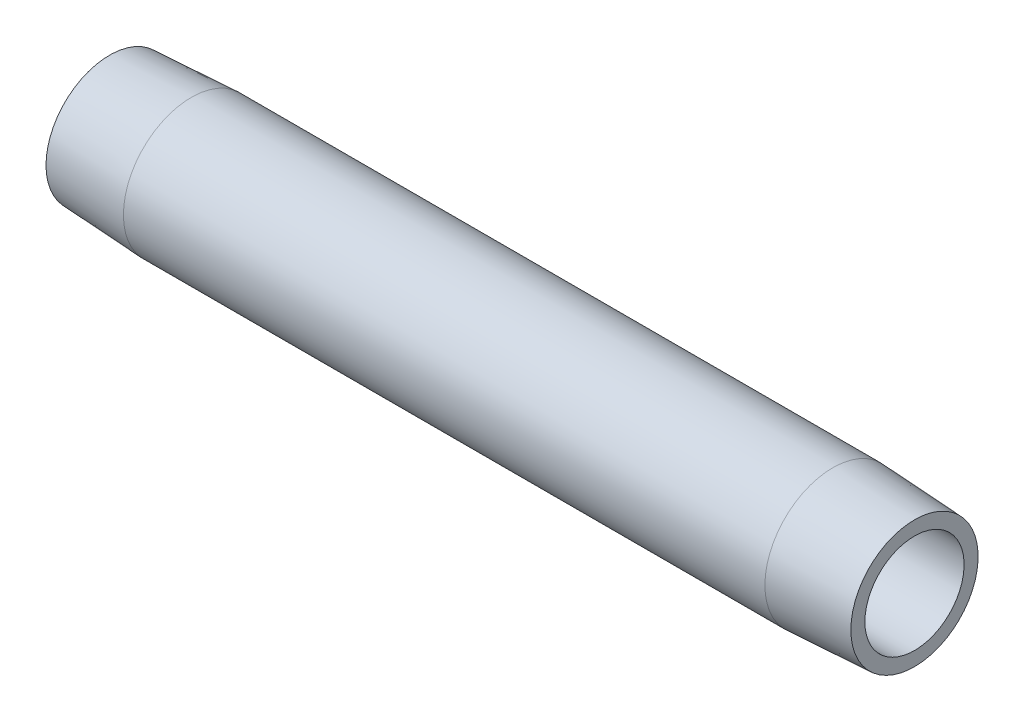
ISO-10303-21;
HEADER;
FILE_DESCRIPTION(('STEP AP214'),'2;1');
FILE_NAME('part.step','',(''),(''),'','','');
FILE_SCHEMA(('AUTOMOTIVE_DESIGN { 1 0 10303 214 1 1 1 1 }'));
ENDSEC;
DATA;
#1=APPLICATION_CONTEXT('core data for automotive mechanical design processes');
#2=APPLICATION_PROTOCOL_DEFINITION('international standard','automotive_design',2000,#1);
#3=PRODUCT_CONTEXT('',#1,'mechanical');
#4=PRODUCT('Part','Part','',(#3));
#5=PRODUCT_RELATED_PRODUCT_CATEGORY('part','',(#4));
#6=PRODUCT_DEFINITION_FORMATION('','',#4);
#7=PRODUCT_DEFINITION_CONTEXT('part definition',#1,'design');
#8=PRODUCT_DEFINITION('design','',#6,#7);
#9=PRODUCT_DEFINITION_SHAPE('','',#8);
#10=(LENGTH_UNIT() NAMED_UNIT(*) SI_UNIT(.MILLI.,.METRE.));
#11=(NAMED_UNIT(*) PLANE_ANGLE_UNIT() SI_UNIT($,.RADIAN.));
#12=(NAMED_UNIT(*) SI_UNIT($,.STERADIAN.) SOLID_ANGLE_UNIT());
#13=UNCERTAINTY_MEASURE_WITH_UNIT(LENGTH_MEASURE(1.E-05),#10,'distance_accuracy_value','');
#14=(GEOMETRIC_REPRESENTATION_CONTEXT(3) GLOBAL_UNCERTAINTY_ASSIGNED_CONTEXT((#13)) GLOBAL_UNIT_ASSIGNED_CONTEXT((#10,
#11,#12)) REPRESENTATION_CONTEXT('',''));
#15=CARTESIAN_POINT('',(0.,0.,0.));
#16=DIRECTION('',(0.,0.,1.));
#17=DIRECTION('',(1.,0.,0.));
#18=AXIS2_PLACEMENT_3D('',#15,#16,#17);
#19=CARTESIAN_POINT('',(101.6,6.26110000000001,0.));
#20=DIRECTION('',(-1.,0.,0.));
#21=DIRECTION('',(0.,0.,1.));
#22=AXIS2_PLACEMENT_3D('',#19,#20,#21);
#23=PLANE('',#22);
#24=CARTESIAN_POINT('',(101.6,0.,0.));
#25=DIRECTION('',(-1.,0.,0.));
#26=DIRECTION('',(0.,0.,1.));
#27=AXIS2_PLACEMENT_3D('',#24,#25,#26);
#28=CIRCLE('',#27,8.03205001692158);
#29=CARTESIAN_POINT('',(101.6,0.,8.03205001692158));
#30=VERTEX_POINT('',#29);
#31=EDGE_CURVE('E10',#30,#30,#28,.T.);
#32=ORIENTED_EDGE('',*,*,#31,.F.);
#33=EDGE_LOOP('',(#32));
#34=FACE_BOUND('',#33,.T.);
#35=CARTESIAN_POINT('',(101.6,0.,0.));
#36=DIRECTION('',(-1.,0.,0.));
#37=DIRECTION('',(0.,0.,1.));
#38=AXIS2_PLACEMENT_3D('',#35,#36,#37);
#39=CIRCLE('',#38,6.26110000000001);
#40=CARTESIAN_POINT('',(101.6,0.,6.26110000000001));
#41=VERTEX_POINT('',#40);
#42=EDGE_CURVE('E52',#41,#41,#39,.T.);
#43=ORIENTED_EDGE('',*,*,#42,.T.);
#44=EDGE_LOOP('',(#43));
#45=FACE_BOUND('',#44,.T.);
#46=ADVANCED_FACE('F30',(#34,#45),#23,.F.);
#47=CARTESIAN_POINT('',(101.6,0.,0.));
#48=DIRECTION('',(-1.,0.,0.));
#49=DIRECTION('',(0.,0.,1.));
#50=AXIS2_PLACEMENT_3D('',#47,#48,#49);
#51=CONICAL_SURFACE('',#50,8.03205001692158,0.0523598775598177);
#52=CARTESIAN_POINT('',(91.2876,0.,0.));
#53=DIRECTION('',(-1.,0.,0.));
#54=DIRECTION('',(0.,0.,1.));
#55=AXIS2_PLACEMENT_3D('',#52,#53,#54);
#56=CIRCLE('',#55,8.57249999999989);
#57=CARTESIAN_POINT('',(91.2876,0.,8.57249999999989));
#58=VERTEX_POINT('',#57);
#59=EDGE_CURVE('E36',#58,#58,#56,.T.);
#60=ORIENTED_EDGE('',*,*,#59,.F.);
#61=EDGE_LOOP('',(#60));
#62=FACE_BOUND('',#61,.T.);
#63=ORIENTED_EDGE('',*,*,#31,.T.);
#64=EDGE_LOOP('',(#63));
#65=FACE_BOUND('',#64,.T.);
#66=ADVANCED_FACE('F77',(#62,#65),#51,.T.);
#67=CARTESIAN_POINT('',(0.,0.,0.));
#68=DIRECTION('',(-1.,0.,0.));
#69=DIRECTION('',(0.,0.,1.));
#70=AXIS2_PLACEMENT_3D('',#67,#68,#69);
#71=CYLINDRICAL_SURFACE('',#70,8.57249999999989);
#72=CARTESIAN_POINT('',(10.3124,0.,0.));
#73=DIRECTION('',(-1.,0.,0.));
#74=DIRECTION('',(0.,0.,1.));
#75=AXIS2_PLACEMENT_3D('',#72,#73,#74);
#76=CIRCLE('',#75,8.57249999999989);
#77=CARTESIAN_POINT('',(10.3124,0.,8.57249999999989));
#78=VERTEX_POINT('',#77);
#79=EDGE_CURVE('E40',#78,#78,#76,.T.);
#80=ORIENTED_EDGE('',*,*,#79,.F.);
#81=EDGE_LOOP('',(#80));
#82=FACE_BOUND('',#81,.T.);
#83=ORIENTED_EDGE('',*,*,#59,.T.);
#84=EDGE_LOOP('',(#83));
#85=FACE_BOUND('',#84,.T.);
#86=ADVANCED_FACE('F72',(#82,#85),#71,.T.);
#87=CARTESIAN_POINT('',(10.3124,0.,0.));
#88=DIRECTION('',(1.,0.,0.));
#89=DIRECTION('',(0.,0.,-1.));
#90=AXIS2_PLACEMENT_3D('',#87,#88,#89);
#91=CONICAL_SURFACE('',#90,8.57249999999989,0.0523598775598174);
#92=CARTESIAN_POINT('',(0.,0.,0.));
#93=DIRECTION('',(-1.,0.,0.));
#94=DIRECTION('',(0.,0.,1.));
#95=AXIS2_PLACEMENT_3D('',#92,#93,#94);
#96=CIRCLE('',#95,8.03205001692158);
#97=CARTESIAN_POINT('',(0.,0.,8.03205001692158));
#98=VERTEX_POINT('',#97);
#99=EDGE_CURVE('E44',#98,#98,#96,.T.);
#100=ORIENTED_EDGE('',*,*,#99,.F.);
#101=EDGE_LOOP('',(#100));
#102=FACE_BOUND('',#101,.T.);
#103=ORIENTED_EDGE('',*,*,#79,.T.);
#104=EDGE_LOOP('',(#103));
#105=FACE_BOUND('',#104,.T.);
#106=ADVANCED_FACE('F66',(#102,#105),#91,.T.);
#107=CARTESIAN_POINT('',(0.,6.26110000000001,0.));
#108=DIRECTION('',(1.,0.,0.));
#109=DIRECTION('',(0.,0.,-1.));
#110=AXIS2_PLACEMENT_3D('',#107,#108,#109);
#111=PLANE('',#110);
#112=CARTESIAN_POINT('',(0.,0.,0.));
#113=DIRECTION('',(-1.,0.,0.));
#114=DIRECTION('',(0.,0.,1.));
#115=AXIS2_PLACEMENT_3D('',#112,#113,#114);
#116=CIRCLE('',#115,6.26110000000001);
#117=CARTESIAN_POINT('',(0.,0.,6.26110000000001));
#118=VERTEX_POINT('',#117);
#119=EDGE_CURVE('E49',#118,#118,#116,.T.);
#120=ORIENTED_EDGE('',*,*,#119,.F.);
#121=EDGE_LOOP('',(#120));
#122=FACE_BOUND('',#121,.T.);
#123=ORIENTED_EDGE('',*,*,#99,.T.);
#124=EDGE_LOOP('',(#123));
#125=FACE_BOUND('',#124,.T.);
#126=ADVANCED_FACE('F60',(#122,#125),#111,.F.);
#127=CARTESIAN_POINT('',(0.,0.,0.));
#128=DIRECTION('',(-1.,0.,0.));
#129=DIRECTION('',(0.,0.,1.));
#130=AXIS2_PLACEMENT_3D('',#127,#128,#129);
#131=CYLINDRICAL_SURFACE('',#130,6.26110000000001);
#132=ORIENTED_EDGE('',*,*,#42,.F.);
#133=EDGE_LOOP('',(#132));
#134=FACE_BOUND('',#133,.T.);
#135=ORIENTED_EDGE('',*,*,#119,.T.);
#136=EDGE_LOOP('',(#135));
#137=FACE_BOUND('',#136,.T.);
#138=ADVANCED_FACE('F57',(#134,#137),#131,.F.);
#139=CLOSED_SHELL('',(#46,#66,#86,#106,#126,#138));
#140=MANIFOLD_SOLID_BREP('B2',#139);
#141=ADVANCED_BREP_SHAPE_REPRESENTATION('',(#18,#140),#14);
#142=SHAPE_DEFINITION_REPRESENTATION(#9,#141);
ENDSEC;
END-ISO-10303-21;
